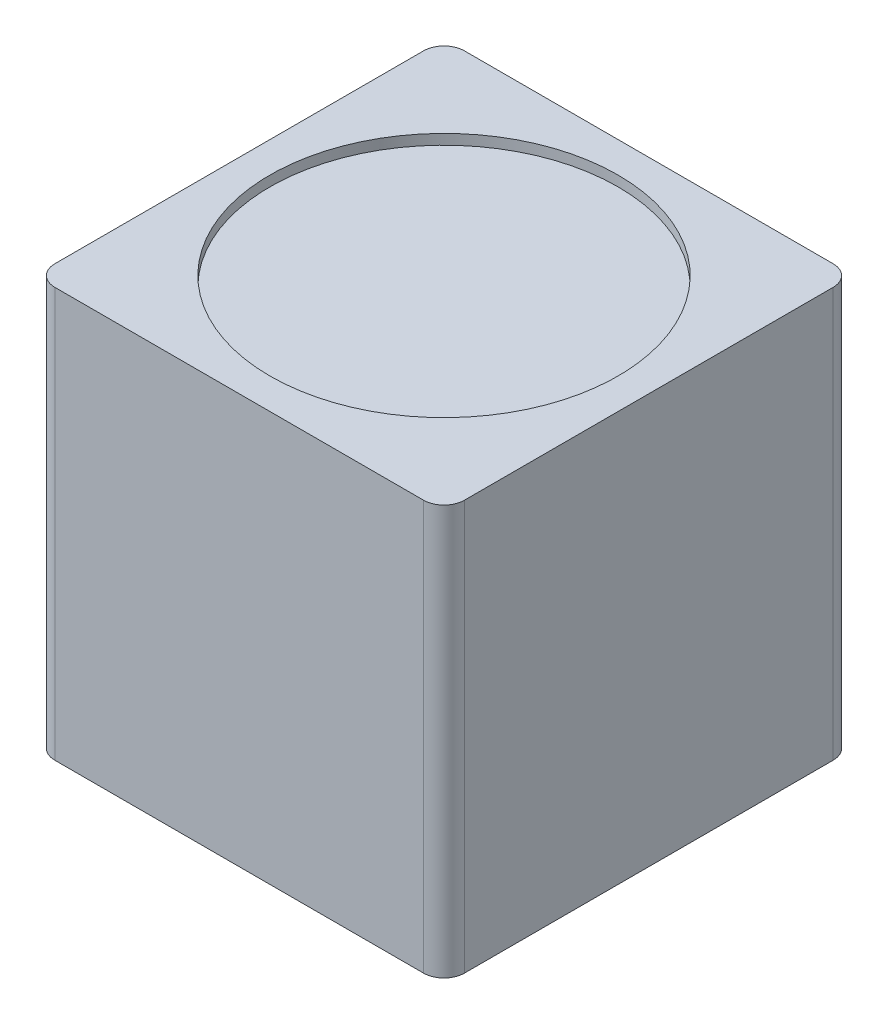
from build123d import *

# Parameters (mm, degrees)
SKETCH1_W               = 20
SKETCH1_H               = 20
BOSS_EXTRUDE1_DEPTH     = 20
CUT_EXTRUDE1_DEPTH      = 35.641016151
CUT_EXTRUDE1_DEPTH_BACK = 0.5
SKETCH2_R               = 8.5
FILLET1_R               = 1


with BuildPart() as part:
    # Sketch1 → Boss-Extrude1 (new body)
    with BuildSketch(Plane.XY):
        with Locations((10, 10)):
            Rectangle(SKETCH1_W, SKETCH1_H)
    extrude(amount=BOSS_EXTRUDE1_DEPTH)

    # Sketch2 → Cut-Extrude1 (cut, two sides: drawn at the far end of the back side and taken through both)
    with BuildSketch(Plane(origin=(0, 20, 0), x_dir=(1, 0, 0), z_dir=(0, 1, 0)).offset(-CUT_EXTRUDE1_DEPTH_BACK)):
        with Locations(Location((10, -10, 0), (0, 0, 90))):
            Circle(SKETCH2_R)
    extrude(amount=CUT_EXTRUDE1_DEPTH + CUT_EXTRUDE1_DEPTH_BACK, mode=Mode.SUBTRACT)

    # Fillet1
    fillet1_edges = [part.edges().sort_by_distance(p)[0] for p in [
        (20, 10, 20),
        (0, 10, 20),
        (20, 10, 0),
        (0, 10, 0),
    ]]
    fillet(fillet1_edges, radius=FILLET1_R)


solid = part.part
